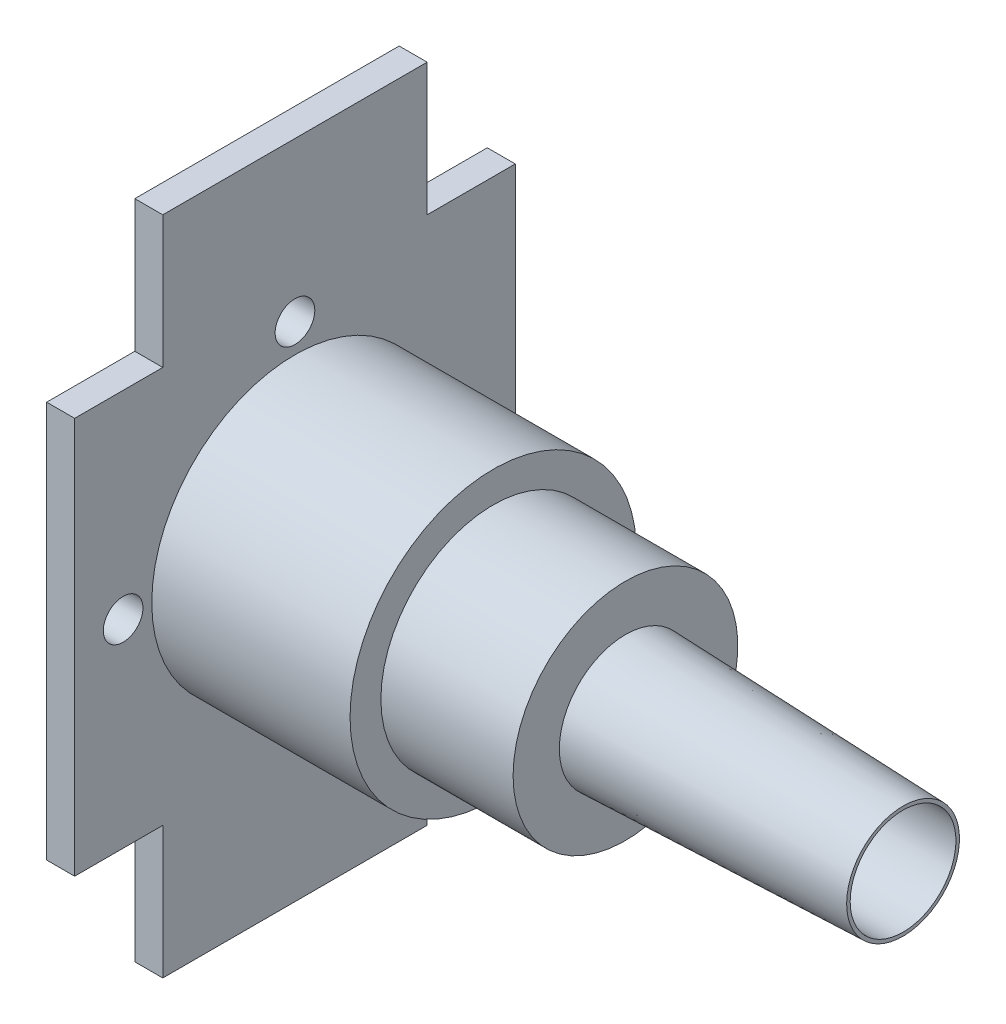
ISO-10303-21;
HEADER;
FILE_DESCRIPTION(('STEP AP214'),'2;1');
FILE_NAME('part.step','',(''),(''),'','','');
FILE_SCHEMA(('AUTOMOTIVE_DESIGN { 1 0 10303 214 1 1 1 1 }'));
ENDSEC;
DATA;
#1=APPLICATION_CONTEXT('core data for automotive mechanical design processes');
#2=APPLICATION_PROTOCOL_DEFINITION('international standard','automotive_design',2000,#1);
#3=PRODUCT_CONTEXT('',#1,'mechanical');
#4=PRODUCT('Part','Part','',(#3));
#5=PRODUCT_RELATED_PRODUCT_CATEGORY('part','',(#4));
#6=PRODUCT_DEFINITION_FORMATION('','',#4);
#7=PRODUCT_DEFINITION_CONTEXT('part definition',#1,'design');
#8=PRODUCT_DEFINITION('design','',#6,#7);
#9=PRODUCT_DEFINITION_SHAPE('','',#8);
#10=(LENGTH_UNIT() NAMED_UNIT(*) SI_UNIT(.MILLI.,.METRE.));
#11=(NAMED_UNIT(*) PLANE_ANGLE_UNIT() SI_UNIT($,.RADIAN.));
#12=(NAMED_UNIT(*) SI_UNIT($,.STERADIAN.) SOLID_ANGLE_UNIT());
#13=UNCERTAINTY_MEASURE_WITH_UNIT(LENGTH_MEASURE(1.E-05),#10,'distance_accuracy_value','');
#14=(GEOMETRIC_REPRESENTATION_CONTEXT(3) GLOBAL_UNCERTAINTY_ASSIGNED_CONTEXT((#13)) GLOBAL_UNIT_ASSIGNED_CONTEXT((#10,
#11,#12)) REPRESENTATION_CONTEXT('',''));
#15=CARTESIAN_POINT('',(0.,0.,0.));
#16=DIRECTION('',(0.,0.,1.));
#17=DIRECTION('',(1.,0.,0.));
#18=AXIS2_PLACEMENT_3D('',#15,#16,#17);
#19=CARTESIAN_POINT('',(144.35,0.,0.));
#20=DIRECTION('',(-1.,0.,0.));
#21=DIRECTION('',(0.,0.,1.));
#22=AXIS2_PLACEMENT_3D('',#19,#20,#21);
#23=PLANE('',#22);
#24=CARTESIAN_POINT('',(144.35,0.,0.));
#25=DIRECTION('',(-1.,0.,0.));
#26=DIRECTION('',(0.,0.,1.));
#27=AXIS2_PLACEMENT_3D('',#24,#25,#26);
#28=CIRCLE('',#27,12.7999915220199);
#29=CARTESIAN_POINT('',(144.35,0.,12.7999915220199));
#30=VERTEX_POINT('',#29);
#31=EDGE_CURVE('E222',#30,#30,#28,.T.);
#32=ORIENTED_EDGE('',*,*,#31,.F.);
#33=EDGE_LOOP('',(#32));
#34=FACE_BOUND('',#33,.T.);
#35=CARTESIAN_POINT('',(144.35,0.,0.));
#36=DIRECTION('',(-1.,0.,0.));
#37=DIRECTION('',(0.,0.,1.));
#38=AXIS2_PLACEMENT_3D('',#35,#36,#37);
#39=CIRCLE('',#38,12.);
#40=CARTESIAN_POINT('',(144.35,0.,12.));
#41=VERTEX_POINT('',#40);
#42=EDGE_CURVE('E406',#41,#41,#39,.T.);
#43=ORIENTED_EDGE('',*,*,#42,.T.);
#44=EDGE_LOOP('',(#43));
#45=FACE_BOUND('',#44,.T.);
#46=ADVANCED_FACE('F34',(#34,#45),#23,.F.);
#47=CARTESIAN_POINT('',(6.35,-75.,50.));
#48=DIRECTION('',(0.,1.,0.));
#49=DIRECTION('',(0.,0.,1.));
#50=AXIS2_PLACEMENT_3D('',#47,#48,#49);
#51=PLANE('',#50);
#52=DIRECTION('',(0.,0.,-1.));
#53=VECTOR('',#52,1.);
#54=CARTESIAN_POINT('',(0.,-75.,50.));
#55=LINE('',#54,#53);
#56=CARTESIAN_POINT('',(0.,-75.,30.));
#57=VERTEX_POINT('',#56);
#58=CARTESIAN_POINT('',(0.,-75.,-30.));
#59=VERTEX_POINT('',#58);
#60=EDGE_CURVE('E138',#57,#59,#55,.T.);
#61=ORIENTED_EDGE('',*,*,#60,.T.);
#62=DIRECTION('',(1.,0.,0.));
#63=VECTOR('',#62,1.);
#64=CARTESIAN_POINT('',(0.,-75.,-30.));
#65=LINE('',#64,#63);
#66=CARTESIAN_POINT('',(6.35,-75.,-30.));
#67=VERTEX_POINT('',#66);
#68=EDGE_CURVE('E121',#59,#67,#65,.T.);
#69=ORIENTED_EDGE('',*,*,#68,.T.);
#70=DIRECTION('',(0.,0.,-1.));
#71=VECTOR('',#70,1.);
#72=CARTESIAN_POINT('',(6.35,-75.,50.));
#73=LINE('',#72,#71);
#74=CARTESIAN_POINT('',(6.35,-75.,30.));
#75=VERTEX_POINT('',#74);
#76=EDGE_CURVE('E157',#75,#67,#73,.T.);
#77=ORIENTED_EDGE('',*,*,#76,.F.);
#78=DIRECTION('',(1.,0.,0.));
#79=VECTOR('',#78,1.);
#80=CARTESIAN_POINT('',(0.,-75.,30.));
#81=LINE('',#80,#79);
#82=EDGE_CURVE('E143',#57,#75,#81,.T.);
#83=ORIENTED_EDGE('',*,*,#82,.F.);
#84=EDGE_LOOP('',(#61,#69,#77,#83));
#85=FACE_BOUND('',#84,.T.);
#86=ADVANCED_FACE('F36',(#85),#51,.F.);
#87=CARTESIAN_POINT('',(6.35,75.,-50.));
#88=DIRECTION('',(0.,0.,1.));
#89=DIRECTION('',(1.,0.,0.));
#90=AXIS2_PLACEMENT_3D('',#87,#88,#89);
#91=PLANE('',#90);
#92=DIRECTION('',(0.,1.,0.));
#93=VECTOR('',#92,1.);
#94=CARTESIAN_POINT('',(6.35,75.,-50.));
#95=LINE('',#94,#93);
#96=CARTESIAN_POINT('',(6.35,-45.,-50.));
#97=VERTEX_POINT('',#96);
#98=CARTESIAN_POINT('',(6.35,45.,-50.));
#99=VERTEX_POINT('',#98);
#100=EDGE_CURVE('E162',#97,#99,#95,.T.);
#101=ORIENTED_EDGE('',*,*,#100,.F.);
#102=DIRECTION('',(1.,0.,0.));
#103=VECTOR('',#102,1.);
#104=CARTESIAN_POINT('',(0.,-45.,-50.));
#105=LINE('',#104,#103);
#106=CARTESIAN_POINT('',(0.,-45.,-50.));
#107=VERTEX_POINT('',#106);
#108=EDGE_CURVE('E129',#107,#97,#105,.T.);
#109=ORIENTED_EDGE('',*,*,#108,.F.);
#110=DIRECTION('',(0.,1.,0.));
#111=VECTOR('',#110,1.);
#112=CARTESIAN_POINT('',(0.,75.,-50.));
#113=LINE('',#112,#111);
#114=CARTESIAN_POINT('',(0.,45.,-50.));
#115=VERTEX_POINT('',#114);
#116=EDGE_CURVE('E144',#107,#115,#113,.T.);
#117=ORIENTED_EDGE('',*,*,#116,.T.);
#118=DIRECTION('',(1.,0.,0.));
#119=VECTOR('',#118,1.);
#120=CARTESIAN_POINT('',(0.,45.,-50.));
#121=LINE('',#120,#119);
#122=EDGE_CURVE('E206',#115,#99,#121,.T.);
#123=ORIENTED_EDGE('',*,*,#122,.T.);
#124=EDGE_LOOP('',(#101,#109,#117,#123));
#125=FACE_BOUND('',#124,.T.);
#126=ADVANCED_FACE('F282',(#125),#91,.F.);
#127=CARTESIAN_POINT('',(6.35,75.,50.));
#128=DIRECTION('',(0.,-1.,0.));
#129=DIRECTION('',(0.,0.,-1.));
#130=AXIS2_PLACEMENT_3D('',#127,#128,#129);
#131=PLANE('',#130);
#132=DIRECTION('',(0.,0.,1.));
#133=VECTOR('',#132,1.);
#134=CARTESIAN_POINT('',(6.35,75.,50.));
#135=LINE('',#134,#133);
#136=CARTESIAN_POINT('',(6.35,75.,-30.));
#137=VERTEX_POINT('',#136);
#138=CARTESIAN_POINT('',(6.35,75.,30.));
#139=VERTEX_POINT('',#138);
#140=EDGE_CURVE('E166',#137,#139,#135,.T.);
#141=ORIENTED_EDGE('',*,*,#140,.F.);
#142=DIRECTION('',(1.,0.,0.));
#143=VECTOR('',#142,1.);
#144=CARTESIAN_POINT('',(0.,75.,-30.));
#145=LINE('',#144,#143);
#146=CARTESIAN_POINT('',(0.,75.,-30.));
#147=VERTEX_POINT('',#146);
#148=EDGE_CURVE('E204',#147,#137,#145,.T.);
#149=ORIENTED_EDGE('',*,*,#148,.F.);
#150=DIRECTION('',(0.,0.,1.));
#151=VECTOR('',#150,1.);
#152=CARTESIAN_POINT('',(0.,75.,50.));
#153=LINE('',#152,#151);
#154=CARTESIAN_POINT('',(0.,75.,30.));
#155=VERTEX_POINT('',#154);
#156=EDGE_CURVE('E147',#147,#155,#153,.T.);
#157=ORIENTED_EDGE('',*,*,#156,.T.);
#158=DIRECTION('',(1.,0.,0.));
#159=VECTOR('',#158,1.);
#160=CARTESIAN_POINT('',(0.,75.,30.));
#161=LINE('',#160,#159);
#162=EDGE_CURVE('E219',#155,#139,#161,.T.);
#163=ORIENTED_EDGE('',*,*,#162,.T.);
#164=EDGE_LOOP('',(#141,#149,#157,#163));
#165=FACE_BOUND('',#164,.T.);
#166=ADVANCED_FACE('F326',(#165),#131,.F.);
#167=CARTESIAN_POINT('',(6.35,75.,50.));
#168=DIRECTION('',(0.,0.,-1.));
#169=DIRECTION('',(-1.,0.,0.));
#170=AXIS2_PLACEMENT_3D('',#167,#168,#169);
#171=PLANE('',#170);
#172=DIRECTION('',(0.,-1.,0.));
#173=VECTOR('',#172,1.);
#174=CARTESIAN_POINT('',(0.,75.,50.));
#175=LINE('',#174,#173);
#176=CARTESIAN_POINT('',(0.,45.,50.));
#177=VERTEX_POINT('',#176);
#178=CARTESIAN_POINT('',(0.,-45.,50.));
#179=VERTEX_POINT('',#178);
#180=EDGE_CURVE('E155',#177,#179,#175,.T.);
#181=ORIENTED_EDGE('',*,*,#180,.T.);
#182=DIRECTION('',(1.,0.,0.));
#183=VECTOR('',#182,1.);
#184=CARTESIAN_POINT('',(0.,-45.,50.));
#185=LINE('',#184,#183);
#186=CARTESIAN_POINT('',(6.35,-45.,50.));
#187=VERTEX_POINT('',#186);
#188=EDGE_CURVE('E183',#179,#187,#185,.T.);
#189=ORIENTED_EDGE('',*,*,#188,.T.);
#190=DIRECTION('',(0.,-1.,0.));
#191=VECTOR('',#190,1.);
#192=CARTESIAN_POINT('',(6.35,75.,50.));
#193=LINE('',#192,#191);
#194=CARTESIAN_POINT('',(6.35,45.,50.));
#195=VERTEX_POINT('',#194);
#196=EDGE_CURVE('E42',#195,#187,#193,.T.);
#197=ORIENTED_EDGE('',*,*,#196,.F.);
#198=DIRECTION('',(1.,0.,0.));
#199=VECTOR('',#198,1.);
#200=CARTESIAN_POINT('',(0.,45.,50.));
#201=LINE('',#200,#199);
#202=EDGE_CURVE('E182',#177,#195,#201,.T.);
#203=ORIENTED_EDGE('',*,*,#202,.F.);
#204=EDGE_LOOP('',(#181,#189,#197,#203));
#205=FACE_BOUND('',#204,.T.);
#206=ADVANCED_FACE('F181',(#205),#171,.F.);
#207=CARTESIAN_POINT('',(6.35,-75.,-50.));
#208=DIRECTION('',(-1.,0.,0.));
#209=DIRECTION('',(0.,0.,1.));
#210=AXIS2_PLACEMENT_3D('',#207,#208,#209);
#211=PLANE('',#210);
#212=CARTESIAN_POINT('',(6.35,4.08503316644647E-13,39.));
#213=DIRECTION('',(1.,0.,0.));
#214=DIRECTION('',(0.,0.,1.));
#215=AXIS2_PLACEMENT_3D('',#212,#213,#214);
#216=CIRCLE('',#215,4.5);
#217=CARTESIAN_POINT('',(6.35,4.55638314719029E-13,43.5));
#218=VERTEX_POINT('',#217);
#219=EDGE_CURVE('E228',#218,#218,#216,.T.);
#220=ORIENTED_EDGE('',*,*,#219,.F.);
#221=EDGE_LOOP('',(#220));
#222=FACE_BOUND('',#221,.T.);
#223=CARTESIAN_POINT('',(6.35,-39.,0.));
#224=DIRECTION('',(1.,0.,0.));
#225=DIRECTION('',(0.,-1.,0.));
#226=AXIS2_PLACEMENT_3D('',#223,#224,#225);
#227=CIRCLE('',#226,4.5);
#228=CARTESIAN_POINT('',(6.35,-43.5,0.));
#229=VERTEX_POINT('',#228);
#230=EDGE_CURVE('E232',#229,#229,#227,.T.);
#231=ORIENTED_EDGE('',*,*,#230,.F.);
#232=EDGE_LOOP('',(#231));
#233=FACE_BOUND('',#232,.T.);
#234=CARTESIAN_POINT('',(6.35,-1.36167772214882E-13,-39.));
#235=DIRECTION('',(1.,0.,0.));
#236=DIRECTION('',(0.,0.,-1.));
#237=AXIS2_PLACEMENT_3D('',#234,#235,#236);
#238=CIRCLE('',#237,4.5);
#239=CARTESIAN_POINT('',(6.35,-1.51879438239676E-13,-43.5));
#240=VERTEX_POINT('',#239);
#241=EDGE_CURVE('E238',#240,#240,#238,.T.);
#242=ORIENTED_EDGE('',*,*,#241,.F.);
#243=EDGE_LOOP('',(#242));
#244=FACE_BOUND('',#243,.T.);
#245=CARTESIAN_POINT('',(6.35,39.,0.));
#246=DIRECTION('',(1.,0.,0.));
#247=DIRECTION('',(0.,1.,0.));
#248=AXIS2_PLACEMENT_3D('',#245,#246,#247);
#249=CIRCLE('',#248,4.5);
#250=CARTESIAN_POINT('',(6.35,43.5,0.));
#251=VERTEX_POINT('',#250);
#252=EDGE_CURVE('E244',#251,#251,#249,.T.);
#253=ORIENTED_EDGE('',*,*,#252,.F.);
#254=EDGE_LOOP('',(#253));
#255=FACE_BOUND('',#254,.T.);
#256=CARTESIAN_POINT('',(6.35,0.,0.));
#257=DIRECTION('',(-1.,0.,0.));
#258=DIRECTION('',(0.,0.,1.));
#259=AXIS2_PLACEMENT_3D('',#256,#257,#258);
#260=CIRCLE('',#259,32.5);
#261=CARTESIAN_POINT('',(6.35,0.,32.5));
#262=VERTEX_POINT('',#261);
#263=EDGE_CURVE('E250',#262,#262,#260,.T.);
#264=ORIENTED_EDGE('',*,*,#263,.T.);
#265=EDGE_LOOP('',(#264));
#266=FACE_BOUND('',#265,.T.);
#267=ORIENTED_EDGE('',*,*,#76,.T.);
#268=DIRECTION('',(0.,-1.,0.));
#269=VECTOR('',#268,1.);
#270=CARTESIAN_POINT('',(6.35,-75.,-30.));
#271=LINE('',#270,#269);
#272=CARTESIAN_POINT('',(6.35,-45.,-30.));
#273=VERTEX_POINT('',#272);
#274=EDGE_CURVE('E124',#273,#67,#271,.T.);
#275=ORIENTED_EDGE('',*,*,#274,.F.);
#276=DIRECTION('',(0.,0.,1.));
#277=VECTOR('',#276,1.);
#278=CARTESIAN_POINT('',(6.35,-45.,-50.));
#279=LINE('',#278,#277);
#280=EDGE_CURVE('E140',#97,#273,#279,.T.);
#281=ORIENTED_EDGE('',*,*,#280,.F.);
#282=ORIENTED_EDGE('',*,*,#100,.T.);
#283=DIRECTION('',(0.,0.,-1.));
#284=VECTOR('',#283,1.);
#285=CARTESIAN_POINT('',(6.35,45.,-50.));
#286=LINE('',#285,#284);
#287=CARTESIAN_POINT('',(6.35,45.,-30.));
#288=VERTEX_POINT('',#287);
#289=EDGE_CURVE('E188',#288,#99,#286,.T.);
#290=ORIENTED_EDGE('',*,*,#289,.F.);
#291=DIRECTION('',(0.,-1.,0.));
#292=VECTOR('',#291,1.);
#293=CARTESIAN_POINT('',(6.35,45.,-30.));
#294=LINE('',#293,#292);
#295=EDGE_CURVE('E184',#137,#288,#294,.T.);
#296=ORIENTED_EDGE('',*,*,#295,.F.);
#297=ORIENTED_EDGE('',*,*,#140,.T.);
#298=DIRECTION('',(0.,1.,0.));
#299=VECTOR('',#298,1.);
#300=CARTESIAN_POINT('',(6.35,45.,30.));
#301=LINE('',#300,#299);
#302=CARTESIAN_POINT('',(6.35,45.,30.));
#303=VERTEX_POINT('',#302);
#304=EDGE_CURVE('E214',#303,#139,#301,.T.);
#305=ORIENTED_EDGE('',*,*,#304,.F.);
#306=DIRECTION('',(0.,0.,-1.));
#307=VECTOR('',#306,1.);
#308=CARTESIAN_POINT('',(6.35,45.,30.));
#309=LINE('',#308,#307);
#310=EDGE_CURVE('E180',#195,#303,#309,.T.);
#311=ORIENTED_EDGE('',*,*,#310,.F.);
#312=ORIENTED_EDGE('',*,*,#196,.T.);
#313=DIRECTION('',(0.,0.,1.));
#314=VECTOR('',#313,1.);
#315=CARTESIAN_POINT('',(6.35,-45.,30.));
#316=LINE('',#315,#314);
#317=CARTESIAN_POINT('',(6.35,-45.,30.));
#318=VERTEX_POINT('',#317);
#319=EDGE_CURVE('E178',#318,#187,#316,.T.);
#320=ORIENTED_EDGE('',*,*,#319,.F.);
#321=DIRECTION('',(0.,1.,0.));
#322=VECTOR('',#321,1.);
#323=CARTESIAN_POINT('',(6.35,-75.,30.));
#324=LINE('',#323,#322);
#325=EDGE_CURVE('E414',#75,#318,#324,.T.);
#326=ORIENTED_EDGE('',*,*,#325,.F.);
#327=EDGE_LOOP('',(#267,#275,#281,#282,#290,#296,#297,#305,#311,#312,#320,#326));
#328=FACE_BOUND('',#327,.T.);
#329=ADVANCED_FACE('F177',(#222,#233,#244,#255,#266,#328),#211,.F.);
#330=CARTESIAN_POINT('',(0.,-75.,-50.));
#331=DIRECTION('',(-1.,0.,0.));
#332=DIRECTION('',(0.,0.,1.));
#333=AXIS2_PLACEMENT_3D('',#330,#331,#332);
#334=PLANE('',#333);
#335=DIRECTION('',(0.,-1.,0.));
#336=VECTOR('',#335,1.);
#337=CARTESIAN_POINT('',(0.,-75.,-30.));
#338=LINE('',#337,#336);
#339=CARTESIAN_POINT('',(0.,-45.,-30.));
#340=VERTEX_POINT('',#339);
#341=EDGE_CURVE('E49',#340,#59,#338,.T.);
#342=ORIENTED_EDGE('',*,*,#341,.T.);
#343=ORIENTED_EDGE('',*,*,#60,.F.);
#344=DIRECTION('',(0.,1.,0.));
#345=VECTOR('',#344,1.);
#346=CARTESIAN_POINT('',(0.,-75.,30.));
#347=LINE('',#346,#345);
#348=CARTESIAN_POINT('',(0.,-45.,30.));
#349=VERTEX_POINT('',#348);
#350=EDGE_CURVE('E416',#57,#349,#347,.T.);
#351=ORIENTED_EDGE('',*,*,#350,.T.);
#352=DIRECTION('',(0.,0.,1.));
#353=VECTOR('',#352,1.);
#354=CARTESIAN_POINT('',(0.,-45.,30.));
#355=LINE('',#354,#353);
#356=EDGE_CURVE('E57',#349,#179,#355,.T.);
#357=ORIENTED_EDGE('',*,*,#356,.T.);
#358=ORIENTED_EDGE('',*,*,#180,.F.);
#359=DIRECTION('',(0.,0.,-1.));
#360=VECTOR('',#359,1.);
#361=CARTESIAN_POINT('',(0.,45.,30.));
#362=LINE('',#361,#360);
#363=CARTESIAN_POINT('',(0.,45.,30.));
#364=VERTEX_POINT('',#363);
#365=EDGE_CURVE('E210',#177,#364,#362,.T.);
#366=ORIENTED_EDGE('',*,*,#365,.T.);
#367=DIRECTION('',(0.,1.,0.));
#368=VECTOR('',#367,1.);
#369=CARTESIAN_POINT('',(0.,45.,30.));
#370=LINE('',#369,#368);
#371=EDGE_CURVE('E213',#364,#155,#370,.T.);
#372=ORIENTED_EDGE('',*,*,#371,.T.);
#373=ORIENTED_EDGE('',*,*,#156,.F.);
#374=DIRECTION('',(0.,-1.,0.));
#375=VECTOR('',#374,1.);
#376=CARTESIAN_POINT('',(0.,45.,-30.));
#377=LINE('',#376,#375);
#378=CARTESIAN_POINT('',(0.,45.,-30.));
#379=VERTEX_POINT('',#378);
#380=EDGE_CURVE('E195',#147,#379,#377,.T.);
#381=ORIENTED_EDGE('',*,*,#380,.T.);
#382=DIRECTION('',(0.,0.,-1.));
#383=VECTOR('',#382,1.);
#384=CARTESIAN_POINT('',(0.,45.,-50.));
#385=LINE('',#384,#383);
#386=EDGE_CURVE('E198',#379,#115,#385,.T.);
#387=ORIENTED_EDGE('',*,*,#386,.T.);
#388=ORIENTED_EDGE('',*,*,#116,.F.);
#389=DIRECTION('',(0.,0.,1.));
#390=VECTOR('',#389,1.);
#391=CARTESIAN_POINT('',(0.,-45.,-50.));
#392=LINE('',#391,#390);
#393=EDGE_CURVE('E130',#107,#340,#392,.T.);
#394=ORIENTED_EDGE('',*,*,#393,.T.);
#395=EDGE_LOOP('',(#342,#343,#351,#357,#358,#366,#372,#373,#381,#387,#388,#394));
#396=FACE_BOUND('',#395,.T.);
#397=CARTESIAN_POINT('',(0.,4.08503316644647E-13,39.));
#398=DIRECTION('',(1.,0.,0.));
#399=DIRECTION('',(0.,0.,1.));
#400=AXIS2_PLACEMENT_3D('',#397,#398,#399);
#401=CIRCLE('',#400,4.5);
#402=CARTESIAN_POINT('',(0.,4.55638314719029E-13,43.5));
#403=VERTEX_POINT('',#402);
#404=EDGE_CURVE('E229',#403,#403,#401,.T.);
#405=ORIENTED_EDGE('',*,*,#404,.T.);
#406=EDGE_LOOP('',(#405));
#407=FACE_BOUND('',#406,.T.);
#408=CARTESIAN_POINT('',(0.,-39.,0.));
#409=DIRECTION('',(1.,0.,0.));
#410=DIRECTION('',(0.,-1.,0.));
#411=AXIS2_PLACEMENT_3D('',#408,#409,#410);
#412=CIRCLE('',#411,4.5);
#413=CARTESIAN_POINT('',(0.,-43.5,0.));
#414=VERTEX_POINT('',#413);
#415=EDGE_CURVE('E235',#414,#414,#412,.T.);
#416=ORIENTED_EDGE('',*,*,#415,.T.);
#417=EDGE_LOOP('',(#416));
#418=FACE_BOUND('',#417,.T.);
#419=CARTESIAN_POINT('',(0.,-1.36167772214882E-13,-39.));
#420=DIRECTION('',(1.,0.,0.));
#421=DIRECTION('',(0.,0.,-1.));
#422=AXIS2_PLACEMENT_3D('',#419,#420,#421);
#423=CIRCLE('',#422,4.5);
#424=CARTESIAN_POINT('',(0.,-1.51879438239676E-13,-43.5));
#425=VERTEX_POINT('',#424);
#426=EDGE_CURVE('E241',#425,#425,#423,.T.);
#427=ORIENTED_EDGE('',*,*,#426,.T.);
#428=EDGE_LOOP('',(#427));
#429=FACE_BOUND('',#428,.T.);
#430=CARTESIAN_POINT('',(0.,39.,0.));
#431=DIRECTION('',(1.,0.,0.));
#432=DIRECTION('',(0.,1.,0.));
#433=AXIS2_PLACEMENT_3D('',#430,#431,#432);
#434=CIRCLE('',#433,4.5);
#435=CARTESIAN_POINT('',(0.,43.5,0.));
#436=VERTEX_POINT('',#435);
#437=EDGE_CURVE('E247',#436,#436,#434,.T.);
#438=ORIENTED_EDGE('',*,*,#437,.T.);
#439=EDGE_LOOP('',(#438));
#440=FACE_BOUND('',#439,.T.);
#441=ADVANCED_FACE('F135',(#396,#407,#418,#429,#440),#334,.T.);
#442=CARTESIAN_POINT('',(81.35,-25.5,0.));
#443=DIRECTION('',(1.,0.,0.));
#444=DIRECTION('',(0.,0.,-1.));
#445=AXIS2_PLACEMENT_3D('',#442,#443,#444);
#446=PLANE('',#445);
#447=CARTESIAN_POINT('',(81.35,0.,0.));
#448=DIRECTION('',(1.,0.,0.));
#449=DIRECTION('',(0.,0.,-1.));
#450=AXIS2_PLACEMENT_3D('',#447,#448,#449);
#451=CIRCLE('',#450,15.);
#452=CARTESIAN_POINT('',(81.35,0.,-15.));
#453=VERTEX_POINT('',#452);
#454=EDGE_CURVE('E11',#453,#453,#451,.T.);
#455=ORIENTED_EDGE('',*,*,#454,.F.);
#456=EDGE_LOOP('',(#455));
#457=FACE_BOUND('',#456,.T.);
#458=CARTESIAN_POINT('',(81.35,0.,0.));
#459=DIRECTION('',(-1.,0.,0.));
#460=DIRECTION('',(0.,0.,1.));
#461=AXIS2_PLACEMENT_3D('',#458,#459,#460);
#462=CIRCLE('',#461,25.5);
#463=CARTESIAN_POINT('',(81.35,0.,25.5));
#464=VERTEX_POINT('',#463);
#465=EDGE_CURVE('E145',#464,#464,#462,.T.);
#466=ORIENTED_EDGE('',*,*,#465,.F.);
#467=EDGE_LOOP('',(#466));
#468=FACE_BOUND('',#467,.T.);
#469=ADVANCED_FACE('F265',(#457,#468),#446,.T.);
#470=CARTESIAN_POINT('',(6.35,0.,0.));
#471=DIRECTION('',(-1.,0.,0.));
#472=DIRECTION('',(0.,0.,1.));
#473=AXIS2_PLACEMENT_3D('',#470,#471,#472);
#474=CYLINDRICAL_SURFACE('',#473,25.5);
#475=ORIENTED_EDGE('',*,*,#465,.T.);
#476=EDGE_LOOP('',(#475));
#477=FACE_BOUND('',#476,.T.);
#478=CARTESIAN_POINT('',(51.35,0.,0.));
#479=DIRECTION('',(-1.,0.,0.));
#480=DIRECTION('',(0.,0.,1.));
#481=AXIS2_PLACEMENT_3D('',#478,#479,#480);
#482=CIRCLE('',#481,25.5);
#483=CARTESIAN_POINT('',(51.35,0.,25.5));
#484=VERTEX_POINT('',#483);
#485=EDGE_CURVE('E150',#484,#484,#482,.T.);
#486=ORIENTED_EDGE('',*,*,#485,.F.);
#487=EDGE_LOOP('',(#486));
#488=FACE_BOUND('',#487,.T.);
#489=ADVANCED_FACE('F263',(#477,#488),#474,.T.);
#490=CARTESIAN_POINT('',(51.35,-32.5,0.));
#491=DIRECTION('',(1.,0.,0.));
#492=DIRECTION('',(0.,0.,-1.));
#493=AXIS2_PLACEMENT_3D('',#490,#491,#492);
#494=PLANE('',#493);
#495=ORIENTED_EDGE('',*,*,#485,.T.);
#496=EDGE_LOOP('',(#495));
#497=FACE_BOUND('',#496,.T.);
#498=CARTESIAN_POINT('',(51.35,0.,0.));
#499=DIRECTION('',(-1.,0.,0.));
#500=DIRECTION('',(0.,0.,1.));
#501=AXIS2_PLACEMENT_3D('',#498,#499,#500);
#502=CIRCLE('',#501,32.5);
#503=CARTESIAN_POINT('',(51.35,0.,32.5));
#504=VERTEX_POINT('',#503);
#505=EDGE_CURVE('E255',#504,#504,#502,.T.);
#506=ORIENTED_EDGE('',*,*,#505,.F.);
#507=EDGE_LOOP('',(#506));
#508=FACE_BOUND('',#507,.T.);
#509=ADVANCED_FACE('F260',(#497,#508),#494,.T.);
#510=CARTESIAN_POINT('',(6.35,0.,0.));
#511=DIRECTION('',(-1.,0.,0.));
#512=DIRECTION('',(0.,0.,1.));
#513=AXIS2_PLACEMENT_3D('',#510,#511,#512);
#514=CYLINDRICAL_SURFACE('',#513,32.5);
#515=ORIENTED_EDGE('',*,*,#505,.T.);
#516=EDGE_LOOP('',(#515));
#517=FACE_BOUND('',#516,.T.);
#518=ORIENTED_EDGE('',*,*,#263,.F.);
#519=EDGE_LOOP('',(#518));
#520=FACE_BOUND('',#519,.T.);
#521=ADVANCED_FACE('F272',(#517,#520),#514,.T.);
#522=CARTESIAN_POINT('',(0.,39.,0.));
#523=DIRECTION('',(1.,0.,0.));
#524=DIRECTION('',(0.,1.,0.));
#525=AXIS2_PLACEMENT_3D('',#522,#523,#524);
#526=CYLINDRICAL_SURFACE('',#525,4.5);
#527=ORIENTED_EDGE('',*,*,#437,.F.);
#528=EDGE_LOOP('',(#527));
#529=FACE_BOUND('',#528,.T.);
#530=ORIENTED_EDGE('',*,*,#252,.T.);
#531=EDGE_LOOP('',(#530));
#532=FACE_BOUND('',#531,.T.);
#533=ADVANCED_FACE('F305',(#529,#532),#526,.F.);
#534=CARTESIAN_POINT('',(0.,-1.36167772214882E-13,-39.));
#535=DIRECTION('',(1.,0.,0.));
#536=DIRECTION('',(0.,0.,-1.));
#537=AXIS2_PLACEMENT_3D('',#534,#535,#536);
#538=CYLINDRICAL_SURFACE('',#537,4.5);
#539=ORIENTED_EDGE('',*,*,#426,.F.);
#540=EDGE_LOOP('',(#539));
#541=FACE_BOUND('',#540,.T.);
#542=ORIENTED_EDGE('',*,*,#241,.T.);
#543=EDGE_LOOP('',(#542));
#544=FACE_BOUND('',#543,.T.);
#545=ADVANCED_FACE('F301',(#541,#544),#538,.F.);
#546=CARTESIAN_POINT('',(0.,-39.,0.));
#547=DIRECTION('',(1.,0.,0.));
#548=DIRECTION('',(0.,1.,0.));
#549=AXIS2_PLACEMENT_3D('',#546,#547,#548);
#550=CYLINDRICAL_SURFACE('',#549,4.5);
#551=ORIENTED_EDGE('',*,*,#415,.F.);
#552=EDGE_LOOP('',(#551));
#553=FACE_BOUND('',#552,.T.);
#554=ORIENTED_EDGE('',*,*,#230,.T.);
#555=EDGE_LOOP('',(#554));
#556=FACE_BOUND('',#555,.T.);
#557=ADVANCED_FACE('F297',(#553,#556),#550,.F.);
#558=CARTESIAN_POINT('',(0.,4.08503316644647E-13,39.));
#559=DIRECTION('',(1.,0.,0.));
#560=DIRECTION('',(0.,0.,-1.));
#561=AXIS2_PLACEMENT_3D('',#558,#559,#560);
#562=CYLINDRICAL_SURFACE('',#561,4.5);
#563=ORIENTED_EDGE('',*,*,#404,.F.);
#564=EDGE_LOOP('',(#563));
#565=FACE_BOUND('',#564,.T.);
#566=ORIENTED_EDGE('',*,*,#219,.T.);
#567=EDGE_LOOP('',(#566));
#568=FACE_BOUND('',#567,.T.);
#569=ADVANCED_FACE('F293',(#565,#568),#562,.F.);
#570=CARTESIAN_POINT('',(81.35,0.,0.));
#571=DIRECTION('',(-1.,0.,0.));
#572=DIRECTION('',(0.,0.,1.));
#573=AXIS2_PLACEMENT_3D('',#570,#571,#572);
#574=CONICAL_SURFACE('',#573,15.,0.0349065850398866);
#575=ORIENTED_EDGE('',*,*,#31,.T.);
#576=EDGE_LOOP('',(#575));
#577=FACE_BOUND('',#576,.T.);
#578=ORIENTED_EDGE('',*,*,#454,.T.);
#579=EDGE_LOOP('',(#578));
#580=FACE_BOUND('',#579,.T.);
#581=ADVANCED_FACE('F289',(#577,#580),#574,.T.);
#582=CARTESIAN_POINT('',(0.,45.,30.));
#583=DIRECTION('',(0.,0.,-1.));
#584=DIRECTION('',(-1.,0.,0.));
#585=AXIS2_PLACEMENT_3D('',#582,#583,#584);
#586=PLANE('',#585);
#587=ORIENTED_EDGE('',*,*,#304,.T.);
#588=ORIENTED_EDGE('',*,*,#162,.F.);
#589=ORIENTED_EDGE('',*,*,#371,.F.);
#590=DIRECTION('',(1.,0.,0.));
#591=VECTOR('',#590,1.);
#592=CARTESIAN_POINT('',(0.,45.,30.));
#593=LINE('',#592,#591);
#594=EDGE_CURVE('E223',#364,#303,#593,.T.);
#595=ORIENTED_EDGE('',*,*,#594,.T.);
#596=EDGE_LOOP('',(#587,#588,#589,#595));
#597=FACE_BOUND('',#596,.T.);
#598=ADVANCED_FACE('F292',(#597),#586,.F.);
#599=CARTESIAN_POINT('',(0.,45.,30.));
#600=DIRECTION('',(0.,-1.,0.));
#601=DIRECTION('',(0.,0.,-1.));
#602=AXIS2_PLACEMENT_3D('',#599,#600,#601);
#603=PLANE('',#602);
#604=ORIENTED_EDGE('',*,*,#310,.T.);
#605=ORIENTED_EDGE('',*,*,#594,.F.);
#606=ORIENTED_EDGE('',*,*,#365,.F.);
#607=ORIENTED_EDGE('',*,*,#202,.T.);
#608=EDGE_LOOP('',(#604,#605,#606,#607));
#609=FACE_BOUND('',#608,.T.);
#610=ADVANCED_FACE('F287',(#609),#603,.F.);
#611=CARTESIAN_POINT('',(0.,45.,-30.));
#612=DIRECTION('',(0.,0.,1.));
#613=DIRECTION('',(1.,0.,0.));
#614=AXIS2_PLACEMENT_3D('',#611,#612,#613);
#615=PLANE('',#614);
#616=ORIENTED_EDGE('',*,*,#295,.T.);
#617=DIRECTION('',(1.,0.,0.));
#618=VECTOR('',#617,1.);
#619=CARTESIAN_POINT('',(0.,45.,-30.));
#620=LINE('',#619,#618);
#621=EDGE_CURVE('E200',#379,#288,#620,.T.);
#622=ORIENTED_EDGE('',*,*,#621,.F.);
#623=ORIENTED_EDGE('',*,*,#380,.F.);
#624=ORIENTED_EDGE('',*,*,#148,.T.);
#625=EDGE_LOOP('',(#616,#622,#623,#624));
#626=FACE_BOUND('',#625,.T.);
#627=ADVANCED_FACE('F347',(#626),#615,.F.);
#628=CARTESIAN_POINT('',(0.,45.,-50.));
#629=DIRECTION('',(0.,-1.,0.));
#630=DIRECTION('',(0.,0.,-1.));
#631=AXIS2_PLACEMENT_3D('',#628,#629,#630);
#632=PLANE('',#631);
#633=ORIENTED_EDGE('',*,*,#289,.T.);
#634=ORIENTED_EDGE('',*,*,#122,.F.);
#635=ORIENTED_EDGE('',*,*,#386,.F.);
#636=ORIENTED_EDGE('',*,*,#621,.T.);
#637=EDGE_LOOP('',(#633,#634,#635,#636));
#638=FACE_BOUND('',#637,.T.);
#639=ADVANCED_FACE('F344',(#638),#632,.F.);
#640=CARTESIAN_POINT('',(0.,-45.,30.));
#641=DIRECTION('',(0.,1.,0.));
#642=DIRECTION('',(0.,0.,1.));
#643=AXIS2_PLACEMENT_3D('',#640,#641,#642);
#644=PLANE('',#643);
#645=ORIENTED_EDGE('',*,*,#319,.T.);
#646=ORIENTED_EDGE('',*,*,#188,.F.);
#647=ORIENTED_EDGE('',*,*,#356,.F.);
#648=DIRECTION('',(1.,0.,0.));
#649=VECTOR('',#648,1.);
#650=CARTESIAN_POINT('',(0.,-45.,30.));
#651=LINE('',#650,#649);
#652=EDGE_CURVE('E185',#349,#318,#651,.T.);
#653=ORIENTED_EDGE('',*,*,#652,.T.);
#654=EDGE_LOOP('',(#645,#646,#647,#653));
#655=FACE_BOUND('',#654,.T.);
#656=ADVANCED_FACE('F365',(#655),#644,.F.);
#657=CARTESIAN_POINT('',(0.,-75.,30.));
#658=DIRECTION('',(0.,0.,-1.));
#659=DIRECTION('',(-1.,0.,0.));
#660=AXIS2_PLACEMENT_3D('',#657,#658,#659);
#661=PLANE('',#660);
#662=ORIENTED_EDGE('',*,*,#325,.T.);
#663=ORIENTED_EDGE('',*,*,#652,.F.);
#664=ORIENTED_EDGE('',*,*,#350,.F.);
#665=ORIENTED_EDGE('',*,*,#82,.T.);
#666=EDGE_LOOP('',(#662,#663,#664,#665));
#667=FACE_BOUND('',#666,.T.);
#668=ADVANCED_FACE('F366',(#667),#661,.F.);
#669=CARTESIAN_POINT('',(0.,-75.,-30.));
#670=DIRECTION('',(0.,0.,1.));
#671=DIRECTION('',(1.,0.,0.));
#672=AXIS2_PLACEMENT_3D('',#669,#670,#671);
#673=PLANE('',#672);
#674=ORIENTED_EDGE('',*,*,#274,.T.);
#675=ORIENTED_EDGE('',*,*,#68,.F.);
#676=ORIENTED_EDGE('',*,*,#341,.F.);
#677=DIRECTION('',(1.,0.,0.));
#678=VECTOR('',#677,1.);
#679=CARTESIAN_POINT('',(0.,-45.,-30.));
#680=LINE('',#679,#678);
#681=EDGE_CURVE('E412',#340,#273,#680,.T.);
#682=ORIENTED_EDGE('',*,*,#681,.T.);
#683=EDGE_LOOP('',(#674,#675,#676,#682));
#684=FACE_BOUND('',#683,.T.);
#685=ADVANCED_FACE('F122',(#684),#673,.F.);
#686=CARTESIAN_POINT('',(0.,-45.,-50.));
#687=DIRECTION('',(0.,1.,0.));
#688=DIRECTION('',(0.,0.,1.));
#689=AXIS2_PLACEMENT_3D('',#686,#687,#688);
#690=PLANE('',#689);
#691=ORIENTED_EDGE('',*,*,#280,.T.);
#692=ORIENTED_EDGE('',*,*,#681,.F.);
#693=ORIENTED_EDGE('',*,*,#393,.F.);
#694=ORIENTED_EDGE('',*,*,#108,.T.);
#695=EDGE_LOOP('',(#691,#692,#693,#694));
#696=FACE_BOUND('',#695,.T.);
#697=ADVANCED_FACE('F374',(#696),#690,.F.);
#698=CARTESIAN_POINT('',(81.35,0.,0.));
#699=DIRECTION('',(-1.,0.,0.));
#700=DIRECTION('',(0.,0.,1.));
#701=AXIS2_PLACEMENT_3D('',#698,#699,#700);
#702=CYLINDRICAL_SURFACE('',#701,12.);
#703=CARTESIAN_POINT('',(114.35,0.,0.));
#704=DIRECTION('',(-1.,0.,0.));
#705=DIRECTION('',(0.,0.,1.));
#706=AXIS2_PLACEMENT_3D('',#703,#704,#705);
#707=CIRCLE('',#706,12.);
#708=CARTESIAN_POINT('',(114.35,0.,12.));
#709=VERTEX_POINT('',#708);
#710=EDGE_CURVE('E401',#709,#709,#707,.T.);
#711=ORIENTED_EDGE('',*,*,#710,.T.);
#712=EDGE_LOOP('',(#711));
#713=FACE_BOUND('',#712,.T.);
#714=ORIENTED_EDGE('',*,*,#42,.F.);
#715=EDGE_LOOP('',(#714));
#716=FACE_BOUND('',#715,.T.);
#717=ADVANCED_FACE('F377',(#713,#716),#702,.F.);
#718=CARTESIAN_POINT('',(114.35,12.,0.));
#719=DIRECTION('',(1.,0.,0.));
#720=DIRECTION('',(0.,0.,-1.));
#721=AXIS2_PLACEMENT_3D('',#718,#719,#720);
#722=PLANE('',#721);
#723=CARTESIAN_POINT('',(114.35,0.,0.));
#724=DIRECTION('',(-1.,0.,0.));
#725=DIRECTION('',(0.,0.,1.));
#726=AXIS2_PLACEMENT_3D('',#723,#724,#725);
#727=CIRCLE('',#726,11.);
#728=CARTESIAN_POINT('',(114.35,0.,11.));
#729=VERTEX_POINT('',#728);
#730=EDGE_CURVE('E398',#729,#729,#727,.T.);
#731=ORIENTED_EDGE('',*,*,#730,.T.);
#732=EDGE_LOOP('',(#731));
#733=FACE_BOUND('',#732,.T.);
#734=ORIENTED_EDGE('',*,*,#710,.F.);
#735=EDGE_LOOP('',(#734));
#736=FACE_BOUND('',#735,.T.);
#737=ADVANCED_FACE('F381',(#733,#736),#722,.T.);
#738=CARTESIAN_POINT('',(81.35,0.,0.));
#739=DIRECTION('',(-1.,0.,0.));
#740=DIRECTION('',(0.,0.,1.));
#741=AXIS2_PLACEMENT_3D('',#738,#739,#740);
#742=CYLINDRICAL_SURFACE('',#741,11.);
#743=CARTESIAN_POINT('',(81.35,0.,0.));
#744=DIRECTION('',(-1.,0.,0.));
#745=DIRECTION('',(0.,0.,1.));
#746=AXIS2_PLACEMENT_3D('',#743,#744,#745);
#747=CIRCLE('',#746,11.);
#748=CARTESIAN_POINT('',(81.35,0.,11.));
#749=VERTEX_POINT('',#748);
#750=EDGE_CURVE('E397',#749,#749,#747,.T.);
#751=ORIENTED_EDGE('',*,*,#750,.T.);
#752=EDGE_LOOP('',(#751));
#753=FACE_BOUND('',#752,.T.);
#754=ORIENTED_EDGE('',*,*,#730,.F.);
#755=EDGE_LOOP('',(#754));
#756=FACE_BOUND('',#755,.T.);
#757=ADVANCED_FACE('F385',(#753,#756),#742,.F.);
#758=CARTESIAN_POINT('',(81.35,11.,0.));
#759=DIRECTION('',(1.,0.,0.));
#760=DIRECTION('',(0.,0.,-1.));
#761=AXIS2_PLACEMENT_3D('',#758,#759,#760);
#762=PLANE('',#761);
#763=ORIENTED_EDGE('',*,*,#750,.F.);
#764=EDGE_LOOP('',(#763));
#765=FACE_BOUND('',#764,.T.);
#766=ADVANCED_FACE('F389',(#765),#762,.T.);
#767=CLOSED_SHELL('',(#46,#86,#126,#166,#206,#329,#441,#469,#489,#509,#521,#533,#545,#557,#569,
#581,#598,#610,#627,#639,#656,#668,#685,#697,#717,#737,#757,#766));
#768=MANIFOLD_SOLID_BREP('B2',#767);
#769=ADVANCED_BREP_SHAPE_REPRESENTATION('',(#18,#768),#14);
#770=SHAPE_DEFINITION_REPRESENTATION(#9,#769);
ENDSEC;
END-ISO-10303-21;
